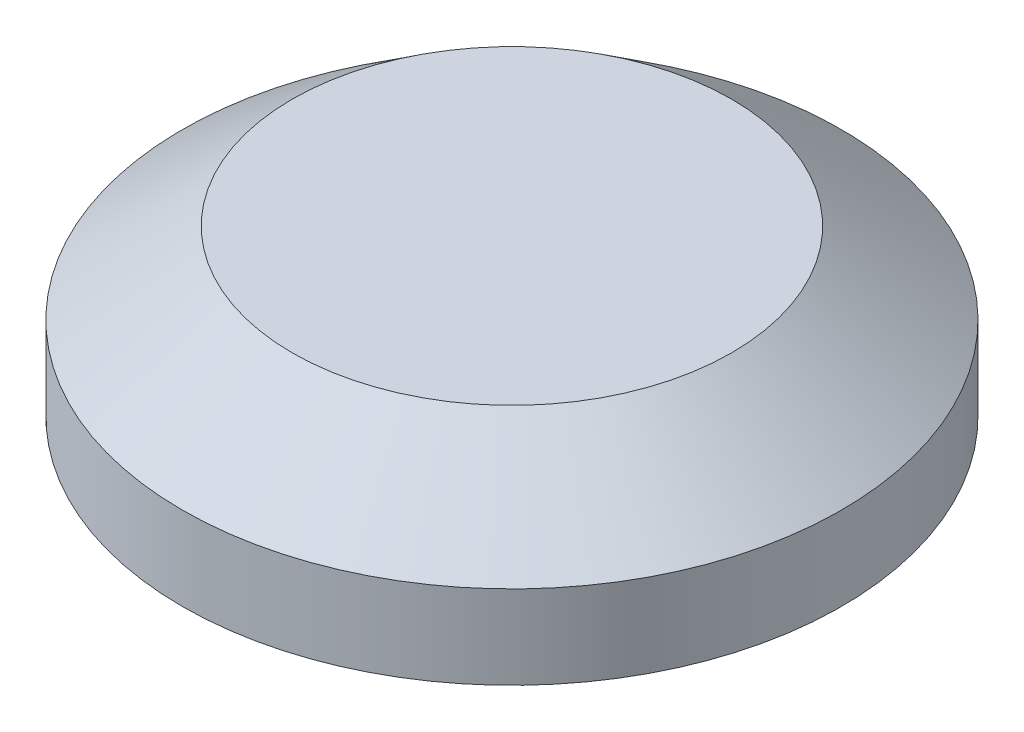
from build123d import *


with BuildPart() as part:
    # Skizze1 → Rotation1 (revolve)
    with BuildSketch(Plane.XY, mode=Mode.PRIVATE) as rotation1_sk:
        Polygon((-6, 0), (0, 0), (0, 3), (-4, 3), (-6, 1.520289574), align=None)
    revolve(rotation1_sk.sketch.rotate(Axis((0, 66.724398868, 0), (0, -1, 0)), 270), axis=Axis((0, 66.724398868, 0), (0, -1, 0)))


solid = part.part
